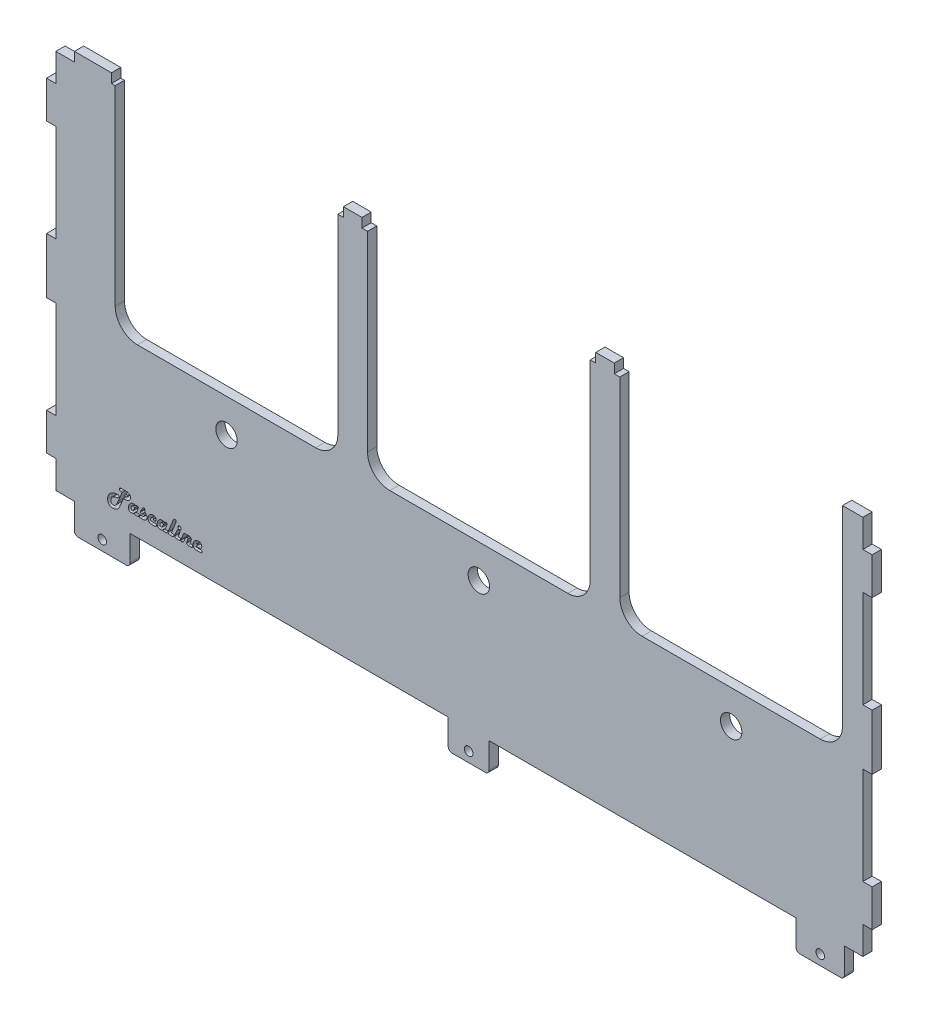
from build123d import *

# Parameters (mm, degrees)
SKETCH1_R             = 3.6703
BOSS_EXTRUDE1_DEPTH   = 3.175
FILLET1_R             = 7.62
SKETCH2_W             = 6.35
SKETCH2_H             = 3.175
SKETCH2_W_2           = 3.175
SKETCH2_H_2           = 12.7
SKETCH2_H_3           = 19.05
SKETCH2_W_3           = 19.05
SKETCH2_H_4           = 10.033
SKETCH2_W_4           = 13.97
SKETCH2_W_5           = 16.51
SKETCH2_W_6           = 12.7
BOSS_EXTRUDE2_DEPTH   = 3.175
F_4_CLEARANCE_HOLE1_D = 2.9464
FILLET2_R             = 1.27
CUT_EXTRUDE1_DEPTH    = 310.607272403


with BuildPart() as part:
    # Sketch1 → Boss-Extrude1 (new body)
    with BuildSketch(Plane.XY):
        Polygon((0, 0), (276.225, 0), (276.225, 130.175), (269.24, 130.175), (269.24, 57.15), (193.04, 57.15), (193.04, 130.175), (182.88, 130.175), (182.88, 57.15), (106.68, 57.15), (106.68, 130.175), (96.52, 130.175), (96.52, 57.15), (20.32, 57.15), (20.32, 130.175), (0, 130.175), align=None)
        with Locations((231.14, 45.72)):
            Circle(SKETCH1_R, mode=Mode.SUBTRACT)
        with Locations((58.42, 45.72)):
            Circle(SKETCH1_R, mode=Mode.SUBTRACT)
        with Locations(Location((144.78, 45.72, 0), (0, 0, 180))):
            Circle(SKETCH1_R, mode=Mode.SUBTRACT)
    extrude(amount=BOSS_EXTRUDE1_DEPTH)

    # Fillet1
    fillet1_edges = [part.edges().sort_by_distance(p)[0] for p in [
        (20.32, 57.15, 1.5875),
        (96.52, 57.15, 1.5875),
        (106.68, 57.15, 1.5875),
        (182.88, 57.15, 1.5875),
        (193.04, 57.15, 1.5875),
        (269.24, 57.15, 1.5875),
    ]]
    fillet(fillet1_edges, radius=FILLET1_R)

    # Sketch2 → Boss-Extrude2 (add)
    with BuildSketch(Plane.XY):
        with Locations((187.96, 131.7625)):
            Rectangle(SKETCH2_W, SKETCH2_H)
        with Locations((277.8125, 114.3)):
            Rectangle(SKETCH2_W_2, SKETCH2_H_2)
        with Locations((277.8125, 15.875)):
            Rectangle(SKETCH2_W_2, SKETCH2_H_2)
        with Locations((-1.5875, 65.0875)):
            Rectangle(SKETCH2_W_2, SKETCH2_H_3)
        with Locations((277.8125, 65.0875)):
            Rectangle(SKETCH2_W_2, SKETCH2_H_3)
        with Locations((-1.5875, 15.875)):
            Rectangle(SKETCH2_W_2, SKETCH2_H_2)
        with Locations((-1.5875, 114.3)):
            Rectangle(SKETCH2_W_2, SKETCH2_H_2)
        with Locations((15.875, -5.0165)):
            Rectangle(SKETCH2_W_3, SKETCH2_H_4)
        with Locations((141.2875, -5.0165)):
            Rectangle(SKETCH2_W_4, SKETCH2_H_4)
        with Locations((261.62, -5.0165)):
            Rectangle(SKETCH2_W_5, SKETCH2_H_4)
        with Locations((101.6, 131.7625)):
            Rectangle(SKETCH2_W, SKETCH2_H)
        with Locations((12.7, 131.7625)):
            Rectangle(SKETCH2_W_6, SKETCH2_H)
    extrude(amount=BOSS_EXTRUDE2_DEPTH)

    # 4 Clearance Hole1 (through all)
    with Locations(Plane.XY.offset(3.175)):
        with Locations((141.2875, -6.604), (261.62, -6.604), (15.875, -6.604)):
            Hole(F_4_CLEARANCE_HOLE1_D / 2)

    # Fillet2
    fillet2_edges = [part.edges().sort_by_distance(p)[0] for p in [
        (269.875, -10.033, 1.5875),
        (253.365, -10.033, 1.5875),
        (148.2725, -10.033, 1.5875),
        (134.3025, -10.033, 1.5875),
        (25.4, -10.033, 1.5875),
        (6.35, -10.033, 1.5875),
    ]]
    fillet(fillet2_edges, radius=FILLET2_R)

    # Sketch5 → Cut-Extrude1 (cut, through all)
    # profile 1 of 10: a face of its own
    with BuildSketch(Plane.XY.offset(3.175)):
        with BuildLine():
            Line((23.119201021, 9.164609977), (22.451206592, 7.500566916))
            add(Edge.make_bspline(
                [(22.451206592, 7.500566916), (22.411003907, 7.401430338), (22.333829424, 7.211124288), (22.219435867, 6.938643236), (22.112680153, 6.690113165), (22.012786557, 6.465475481), (21.920717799, 6.264069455), (21.833533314, 6.087517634), (21.755963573, 5.933870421), (21.661354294, 5.762755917), (21.539114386, 5.572432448), (21.375027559, 5.364837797), (21.194459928, 5.172753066), (21.060129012, 5.059889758), (20.992791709, 5.003313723)],
                knots=[0, 0, 0, 0, 1.315970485, 2.526183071, 3.635244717, 4.643279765, 5.550454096, 6.359128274, 7.065363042, 7.667512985, 8.763908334, 9.843272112, 10.918877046, 12, 12, 12, 12], degree=3))
            add(Edge.make_bspline(
                [(20.992791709, 5.003313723), (20.941866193, 4.965231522), (20.841070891, 4.889856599), (20.680401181, 4.792052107), (20.514563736, 4.708473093), (20.341573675, 4.641675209), (20.163005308, 4.589417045), (19.978244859, 4.551262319), (19.787353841, 4.528037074), (19.658056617, 4.52556047), (19.592618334, 4.524307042)],
                knots=[0, 0, 0, 0, 1.011044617, 2.001129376, 2.987597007, 3.961339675, 4.946518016, 5.943976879, 6.959431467, 8, 8, 8, 8], degree=3))
            add(Edge.make_bspline(
                [(19.592618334, 4.524307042), (19.523985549, 4.52577862), (19.389812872, 4.52865546), (19.193870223, 4.554855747), (19.007122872, 4.594062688), (18.83078106, 4.653339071), (18.663334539, 4.726507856), (18.506601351, 4.817898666), (18.35966799, 4.925082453), (18.22480845, 5.048815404), (18.102569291, 5.184697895), (17.996369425, 5.332046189), (17.904994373, 5.488467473), (17.831448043, 5.655681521), (17.774055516, 5.832504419), (17.734367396, 6.018966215), (17.708307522, 6.214954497), (17.70541107, 6.3491208), (17.70392946, 6.417750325)],
                knots=[0, 0, 0, 0, 1.095039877, 2.140732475, 3.150521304, 4.13652018, 5.104897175, 6.062745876, 7.026672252, 8.00261995, 8.979018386, 9.939223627, 10.897072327, 11.865449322, 12.849478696, 13.859267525, 14.904960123, 16, 16, 16, 16], degree=3))
            add(Edge.make_bspline(
                [(17.70392946, 6.417750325), (17.706469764, 6.510196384), (17.711485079, 6.692712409), (17.750571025, 6.961954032), (17.814671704, 7.222484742), (17.905671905, 7.473969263), (18.021297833, 7.716830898), (18.16431112, 7.949570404), (18.332042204, 8.17426002), (18.460931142, 8.313119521), (18.526442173, 8.383698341)],
                knots=[0, 0, 0, 0, 1.01377589, 2.001495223, 2.977585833, 3.952291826, 4.930103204, 5.92294397, 6.944284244, 8, 8, 8, 8], degree=3))
            add(Edge.make_bspline(
                [(18.526442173, 8.383698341), (18.564038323, 8.421013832), (18.639923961, 8.496332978), (18.762383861, 8.601213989), (18.891389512, 8.701406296), (19.026342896, 8.796968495), (19.169837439, 8.884085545), (19.318539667, 8.968473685), (19.475608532, 9.044630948), (19.690708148, 9.141268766), (19.965425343, 9.241006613), (20.2978387, 9.328678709), (20.629749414, 9.381793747), (20.850767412, 9.389158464), (20.96069945, 9.392821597)],
                knots=[0, 0, 0, 0, 0.706155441, 1.425333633, 2.148189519, 2.883981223, 3.628821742, 4.385725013, 5.163077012, 5.955384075, 7.529784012, 9.053423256, 10.534403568, 12, 12, 12, 12], degree=3))
            add(Edge.make_bspline(
                [(20.96069945, 9.392821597), (21.010777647, 9.391629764), (21.10661754, 9.389348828), (21.242284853, 9.36101028), (21.363435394, 9.317754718), (21.467338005, 9.255678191), (21.552788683, 9.180085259), (21.616087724, 9.091135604), (21.653226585, 8.989078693), (21.657440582, 8.917283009), (21.659597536, 8.880534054)],
                knots=[0, 0, 0, 0, 1.238826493, 2.370872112, 3.417595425, 4.41258701, 5.350953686, 6.225146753, 7.091533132, 8, 8, 8, 8], degree=3))
            add(Edge.make_bspline(
                [(21.659597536, 8.880534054), (21.657158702, 8.841764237), (21.65240403, 8.766179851), (21.612518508, 8.658791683), (21.545055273, 8.564566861), (21.48423124, 8.515858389), (21.452780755, 8.490672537)],
                knots=[0, 0, 0, 0, 1.010937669, 1.970891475, 2.950802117, 4, 4, 4, 4], degree=3))
            add(Edge.make_bspline(
                [(21.452780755, 8.490672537), (21.428650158, 8.476261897), (21.374303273, 8.443806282), (21.271172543, 8.413087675), (21.142728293, 8.387298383), (21.04721528, 8.377274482), (20.995168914, 8.371812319)],
                knots=[0, 0, 0, 0, 0.704559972, 1.586808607, 2.68501851, 4, 4, 4, 4], degree=3))
            add(Edge.make_bspline(
                [(20.995168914, 8.371812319), (20.930899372, 8.36533971), (20.80556437, 8.352717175), (20.622961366, 8.323144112), (20.44919412, 8.289935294), (20.285218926, 8.246571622), (20.130183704, 8.19766871), (19.983692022, 8.144126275), (19.847574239, 8.080489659), (19.761927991, 8.032764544), (19.719798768, 8.009288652)],
                knots=[0, 0, 0, 0, 1.159710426, 2.261604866, 3.320677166, 4.335395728, 5.305245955, 6.239579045, 7.134052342, 8, 8, 8, 8], degree=3))
            add(Edge.make_bspline(
                [(19.719798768, 8.009288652), (19.654419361, 7.967339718), (19.52562533, 7.884702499), (19.354426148, 7.733222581), (19.203332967, 7.564964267), (19.075629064, 7.379109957), (18.973627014, 7.181271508), (18.89879096, 6.976254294), (18.852926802, 6.765270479), (18.847636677, 6.622412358), (18.844987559, 6.550873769)],
                knots=[0, 0, 0, 0, 1.047576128, 2.063670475, 3.075290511, 4.094745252, 5.099666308, 6.072755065, 7.034899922, 8, 8, 8, 8], degree=3))
            add(Edge.make_bspline(
                [(18.844987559, 6.550873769), (18.845636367, 6.515185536), (18.846908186, 6.445228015), (18.857899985, 6.343133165), (18.875018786, 6.246246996), (18.901788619, 6.15588907), (18.933862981, 6.070634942), (18.972695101, 5.990387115), (19.020918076, 5.917086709), (19.073977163, 5.848438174), (19.13513267, 5.788442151), (19.199905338, 5.73415304), (19.271326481, 5.690354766), (19.346543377, 5.652700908), (19.427352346, 5.624580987), (19.513023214, 5.604540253), (19.603256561, 5.590584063), (19.665464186, 5.589730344), (19.697215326, 5.589294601)],
                knots=[0, 0, 0, 0, 1.180906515, 2.314860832, 3.395146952, 4.432720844, 5.428859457, 6.408284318, 7.375873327, 8.328235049, 9.274073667, 10.205991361, 11.119268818, 12.040047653, 12.985704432, 13.943108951, 14.9501506, 16, 16, 16, 16], degree=3))
            add(Edge.make_bspline(
                [(19.697215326, 5.589294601), (19.73772721, 5.590178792), (19.817696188, 5.591924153), (19.934736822, 5.613557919), (20.047745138, 5.64535598), (20.156538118, 5.691126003), (20.261491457, 5.749525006), (20.361851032, 5.821430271), (20.457232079, 5.906838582), (20.550130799, 6.005691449), (20.640514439, 6.122252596), (20.735291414, 6.255321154), (20.829339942, 6.410668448), (20.926497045, 6.585296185), (21.026287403, 6.779583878), (21.128874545, 6.99369617), (21.231187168, 7.22917089), (21.299659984, 7.393110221), (21.335109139, 7.477983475)],
                knots=[0, 0, 0, 0, 0.731682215, 1.444313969, 2.14503258, 2.851587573, 3.573238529, 4.31284086, 5.079201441, 5.885132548, 6.76239785, 7.744387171, 8.838039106, 10.04403949, 11.357848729, 12.787140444, 14.336666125, 16, 16, 16, 16], degree=3))
            Line((21.335109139, 7.477983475), (22.730528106, 10.914232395))
            Line((22.730528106, 10.914232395), (22.293122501, 10.914232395))
            add(Edge.make_bspline(
                [(22.293122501, 10.914232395), (22.249482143, 10.915318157), (22.167784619, 10.917350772), (22.053469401, 10.933486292), (21.955911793, 10.96103767), (21.875553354, 11.001448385), (21.812083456, 11.0538411), (21.766552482, 11.118910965), (21.739607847, 11.196317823), (21.737016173, 11.251577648), (21.735668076, 11.280321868)],
                knots=[0, 0, 0, 0, 1.386647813, 2.595892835, 3.659749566, 4.594681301, 5.434731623, 6.248703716, 7.089037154, 8, 8, 8, 8], degree=3))
            add(Edge.make_bspline(
                [(21.735668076, 11.280321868), (21.737604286, 11.321461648), (21.741339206, 11.400819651), (21.780099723, 11.512122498), (21.841922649, 11.609323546), (21.930694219, 11.688476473), (22.040352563, 11.751577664), (22.17060237, 11.796320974), (22.320267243, 11.821779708), (22.426142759, 11.825246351), (22.482110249, 11.827078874)],
                knots=[0, 0, 0, 0, 0.942601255, 1.818263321, 2.674766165, 3.564433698, 4.523656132, 5.566505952, 6.713616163, 8, 8, 8, 8], degree=3))
            Line((22.482110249, 11.827078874), (24.009464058, 11.827078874))
            add(Edge.make_bspline(
                [(24.009464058, 11.827078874), (24.07248493, 11.826141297), (24.194705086, 11.824322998), (24.371659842, 11.811086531), (24.536158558, 11.790426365), (24.687661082, 11.7598162), (24.826003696, 11.719494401), (24.951704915, 11.670604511), (25.065549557, 11.614116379), (25.166457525, 11.546868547), (25.254881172, 11.47075861), (25.331318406, 11.384834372), (25.394973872, 11.289168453), (25.449869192, 11.185035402), (25.489653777, 11.069843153), (25.51766631, 10.945418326), (25.536143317, 10.81176616), (25.53815736, 10.719365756), (25.539195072, 10.671757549)],
                knots=[0, 0, 0, 0, 1.377685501, 2.671828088, 3.877302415, 5.000186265, 6.047243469, 7.023626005, 7.94558449, 8.820055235, 9.667510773, 10.489711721, 11.325757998, 12.174186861, 13.056345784, 13.980864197, 14.959664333, 16, 16, 16, 16], degree=3))
            add(Edge.make_bspline(
                [(25.539195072, 10.671757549), (25.537217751, 10.613032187), (25.533336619, 10.497764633), (25.507219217, 10.328808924), (25.461558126, 10.168586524), (25.398541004, 10.016101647), (25.315426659, 9.873155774), (25.215734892, 9.73744145), (25.098243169, 9.609536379), (25.007634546, 9.534438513), (24.961534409, 9.496229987)],
                knots=[0, 0, 0, 0, 1.037190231, 2.03582197, 3.010506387, 3.973515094, 4.942177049, 5.923321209, 6.943420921, 8, 8, 8, 8], degree=3))
            add(Edge.make_bspline(
                [(24.961534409, 9.496229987), (24.924861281, 9.469591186), (24.849567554, 9.414898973), (24.722279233, 9.347795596), (24.581294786, 9.290628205), (24.42582274, 9.24494617), (24.257052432, 9.208122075), (24.073914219, 9.182358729), (23.876613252, 9.166850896), (23.740077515, 9.16537344), (23.669523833, 9.164609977)],
                knots=[0, 0, 0, 0, 0.800437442, 1.643380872, 2.535600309, 3.486195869, 4.50417187, 5.586788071, 6.752993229, 8, 8, 8, 8], degree=3))
            Line((23.669523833, 9.164609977), (23.119201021, 9.164609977))
        make_face()
        with BuildLine():
            Line((23.509062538, 10.077456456), (23.833550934, 10.077456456))
            add(Edge.make_bspline(
                [(23.833550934, 10.077456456), (23.883581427, 10.078871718), (23.978009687, 10.081542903), (24.109812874, 10.105830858), (24.222265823, 10.147368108), (24.315221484, 10.206091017), (24.38842248, 10.283422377), (24.437974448, 10.379084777), (24.470358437, 10.489814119), (24.47287967, 10.569284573), (24.474207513, 10.611138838)],
                knots=[0, 0, 0, 0, 1.258971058, 2.376199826, 3.358208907, 4.260347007, 5.121448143, 6.005251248, 6.949436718, 8, 8, 8, 8], degree=3))
            add(Edge.make_bspline(
                [(24.474207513, 10.611138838), (24.473067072, 10.634992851), (24.470906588, 10.680182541), (24.45485612, 10.743618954), (24.424912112, 10.796445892), (24.384765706, 10.841296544), (24.331090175, 10.873849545), (24.267531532, 10.898068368), (24.192697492, 10.911946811), (24.139079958, 10.913437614), (24.110495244, 10.914232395)],
                knots=[0, 0, 0, 0, 1.057975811, 2.004258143, 2.869579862, 3.727735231, 4.644179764, 5.623179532, 6.73286349, 8, 8, 8, 8], degree=3))
            Line((24.110495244, 10.914232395), (23.84187115, 10.914232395))
            Line((23.84187115, 10.914232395), (23.509062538, 10.077456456))
        make_face(mode=Mode.SUBTRACT)
    # profile 2 of 10: a face of its own
    with BuildSketch(Plane.XY.offset(3.175)):
        with BuildLine():
            Line((27.590722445, 7.262846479), (28.032882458, 7.262846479))
            add(Edge.make_bspline(
                [(28.032882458, 7.262846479), (28.069771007, 7.26168404), (28.139217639, 7.259495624), (28.237100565, 7.244044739), (28.319497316, 7.213913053), (28.389453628, 7.175207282), (28.441730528, 7.120759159), (28.479643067, 7.055670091), (28.502815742, 6.978700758), (28.504866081, 6.923472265), (28.505946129, 6.894379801)],
                knots=[0, 0, 0, 0, 1.294214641, 2.436497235, 3.45633191, 4.35958604, 5.214514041, 6.067746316, 6.982155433, 8, 8, 8, 8], degree=3))
            add(Edge.make_bspline(
                [(28.505946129, 6.894379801), (28.504075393, 6.853751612), (28.500488, 6.775841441), (28.467922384, 6.66547908), (28.411237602, 6.570686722), (28.335484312, 6.489620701), (28.239850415, 6.426705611), (28.127852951, 6.380604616), (27.999107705, 6.355527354), (27.90818237, 6.351900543), (27.860535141, 6.35)],
                knots=[0, 0, 0, 0, 1.02006706, 1.956119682, 2.85821293, 3.77438774, 4.72208319, 5.713685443, 6.801912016, 8, 8, 8, 8], degree=3))
            Line((27.860535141, 6.35), (27.347058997, 6.35))
            add(Edge.make_bspline(
                [(27.347058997, 6.35), (27.319272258, 6.350924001), (27.266140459, 6.35269081), (27.189661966, 6.365809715), (27.119931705, 6.388489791), (27.056725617, 6.420297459), (27.001086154, 6.461923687), (26.951568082, 6.511009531), (26.909321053, 6.570088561), (26.888358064, 6.614676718), (26.877561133, 6.637641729)],
                knots=[0, 0, 0, 0, 1.135602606, 2.17141737, 3.159933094, 4.123316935, 5.049777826, 5.988893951, 6.964185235, 8, 8, 8, 8], degree=3))
            add(Edge.make_bspline(
                [(26.877561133, 6.637641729), (26.829418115, 6.593791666), (26.738706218, 6.511168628), (26.589078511, 6.421916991), (26.442765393, 6.360717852), (26.343224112, 6.353490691), (26.295146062, 6.35)],
                knots=[0, 0, 0, 0, 1.172355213, 2.208971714, 3.134940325, 4, 4, 4, 4], degree=3))
            Line((26.295146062, 6.35), (25.838722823, 6.35))
            add(Edge.make_bspline(
                [(25.838722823, 6.35), (25.802613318, 6.350846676), (25.732080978, 6.352500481), (25.629021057, 6.36739538), (25.530996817, 6.390336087), (25.439134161, 6.425910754), (25.351766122, 6.468220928), (25.269891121, 6.521254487), (25.194345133, 6.584489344), (25.123714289, 6.655720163), (25.061392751, 6.735720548), (25.004824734, 6.82093039), (24.958631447, 6.913392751), (24.9203783, 7.011259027), (24.891018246, 7.114802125), (24.869013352, 7.224008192), (24.857836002, 7.339477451), (24.855668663, 7.418533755), (24.854560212, 7.45896584)],
                knots=[0, 0, 0, 0, 1.038881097, 2.029236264, 2.991883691, 3.930308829, 4.858629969, 5.782385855, 6.730121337, 7.689859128, 8.664191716, 9.644845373, 10.629272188, 11.633194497, 12.665607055, 13.723595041, 14.835769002, 16, 16, 16, 16], degree=3))
            add(Edge.make_bspline(
                [(24.854560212, 7.45896584), (24.85610135, 7.520862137), (24.859147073, 7.643186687), (24.885247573, 7.824235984), (24.926425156, 8.000246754), (24.985151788, 8.171403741), (25.060821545, 8.33685869), (25.150817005, 8.498507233), (25.260719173, 8.653277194), (25.383466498, 8.802278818), (25.517065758, 8.939411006), (25.65634466, 9.060947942), (25.801550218, 9.162226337), (25.949498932, 9.247803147), (26.103529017, 9.312208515), (26.26118757, 9.359174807), (26.423717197, 9.387067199), (26.533554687, 9.390897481), (26.588730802, 9.392821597)],
                knots=[0, 0, 0, 0, 1.038393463, 2.052158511, 3.063456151, 4.068635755, 5.08344709, 6.113632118, 7.168837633, 8.264602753, 9.350863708, 10.378663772, 11.361961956, 12.31789787, 13.241700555, 14.156967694, 15.07416527, 16, 16, 16, 16], degree=3))
            add(Edge.make_bspline(
                [(26.588730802, 9.392821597), (26.629955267, 9.391802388), (26.709847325, 9.389827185), (26.825936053, 9.377663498), (26.93284671, 9.352720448), (27.032648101, 9.323430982), (27.12225627, 9.280706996), (27.204008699, 9.230733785), (27.277694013, 9.171469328), (27.318416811, 9.124076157), (27.338738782, 9.100425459)],
                knots=[0, 0, 0, 0, 1.187749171, 2.30183041, 3.353985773, 4.346587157, 5.291117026, 6.203238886, 7.103359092, 8, 8, 8, 8], degree=3))
            add(Edge.make_bspline(
                [(27.338738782, 9.100425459), (27.355674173, 9.123800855), (27.388572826, 9.169209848), (27.444893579, 9.229036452), (27.505129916, 9.279630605), (27.568893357, 9.321936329), (27.638154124, 9.352158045), (27.709275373, 9.377183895), (27.78560771, 9.389834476), (27.837518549, 9.391809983), (27.864100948, 9.392821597)],
                knots=[0, 0, 0, 0, 1.102961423, 2.142610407, 3.131917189, 4.106850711, 5.056016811, 6.014208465, 6.983119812, 8, 8, 8, 8], degree=3))
            add(Edge.make_bspline(
                [(27.864100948, 9.392821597), (27.892332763, 9.391374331), (27.947568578, 9.388542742), (28.026788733, 9.368747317), (28.097661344, 9.332619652), (28.159912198, 9.285477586), (28.212990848, 9.22913499), (28.25007614, 9.163329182), (28.274365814, 9.091402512), (28.276592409, 9.040801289), (28.277734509, 9.014846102)],
                knots=[0, 0, 0, 0, 1.085152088, 2.123110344, 3.11068521, 4.121931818, 5.11360817, 6.061884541, 7.005870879, 8, 8, 8, 8], degree=3))
            add(Edge.make_bspline(
                [(28.277734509, 9.014846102), (28.277038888, 8.995776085), (28.275563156, 8.955319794), (28.262690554, 8.892397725), (28.242496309, 8.824341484), (28.223506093, 8.778549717), (28.213549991, 8.754542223)],
                knots=[0, 0, 0, 0, 0.847236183, 1.797378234, 2.845219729, 4, 4, 4, 4], degree=3))
            Line((28.213549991, 8.754542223), (28.16957171, 8.648756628))
            Line((28.16957171, 8.648756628), (27.590722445, 7.262846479))
        make_face()
        with BuildLine():
            Line((26.134684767, 7.262846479), (26.235715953, 7.262846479))
            add(Edge.make_bspline(
                [(26.235715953, 7.262846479), (26.261118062, 7.263403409), (26.310245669, 7.264480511), (26.380704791, 7.276313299), (26.444219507, 7.296625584), (26.501442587, 7.324150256), (26.551533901, 7.360081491), (26.595304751, 7.403527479), (26.631459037, 7.455722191), (26.649532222, 7.494711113), (26.658858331, 7.514830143)],
                knots=[0, 0, 0, 0, 1.157664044, 2.238919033, 3.244614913, 4.190073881, 5.122668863, 6.042574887, 6.989931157, 8, 8, 8, 8], degree=3))
            Line((26.658858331, 7.514830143), (26.92985963, 8.166184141))
            add(Edge.make_bspline(
                [(26.92985963, 8.166184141), (26.946051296, 8.204845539), (26.974847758, 8.27360384), (26.981585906, 8.347699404), (26.98453533, 8.380132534)],
                knots=[0, 0, 0, 0, 1.124559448, 2, 2, 2, 2], degree=3))
            add(Edge.make_bspline(
                [(26.98453533, 8.380132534), (26.982919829, 8.396510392), (26.979660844, 8.429549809), (26.960273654, 8.478036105), (26.923140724, 8.519372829), (26.877468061, 8.558290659), (26.822149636, 8.591249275), (26.759781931, 8.614843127), (26.692035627, 8.629673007), (26.645070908, 8.631284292), (26.620823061, 8.632116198)],
                knots=[0, 0, 0, 0, 0.81058345, 1.635208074, 2.524363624, 3.523748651, 4.593951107, 5.683817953, 6.804157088, 8, 8, 8, 8], degree=3))
            add(Edge.make_bspline(
                [(26.620823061, 8.632116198), (26.596174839, 8.63128371), (26.546394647, 8.629602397), (26.472572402, 8.613117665), (26.399545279, 8.588130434), (26.327079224, 8.552743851), (26.255132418, 8.507577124), (26.183183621, 8.452598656), (26.113420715, 8.386315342), (26.021876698, 8.289084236), (25.923002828, 8.158030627), (25.834330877, 7.992365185), (25.778103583, 7.822683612), (25.770947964, 7.707389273), (25.767406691, 7.650330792)],
                knots=[0, 0, 0, 0, 0.627706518, 1.267732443, 1.919531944, 2.592823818, 3.31892668, 4.082778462, 4.897707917, 5.769757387, 7.487317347, 9.064628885, 10.547302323, 12, 12, 12, 12], degree=3))
            add(Edge.make_bspline(
                [(25.767406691, 7.650330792), (25.768547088, 7.620143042), (25.770712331, 7.562826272), (25.786711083, 7.482537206), (25.814989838, 7.413874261), (25.857126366, 7.358291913), (25.910530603, 7.314821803), (25.97542406, 7.283164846), (26.051786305, 7.265877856), (26.106072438, 7.263892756), (26.134684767, 7.262846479)],
                knots=[0, 0, 0, 0, 1.183693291, 2.247450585, 3.194323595, 4.070859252, 4.954393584, 5.871857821, 6.878330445, 8, 8, 8, 8], degree=3))
        make_face(mode=Mode.SUBTRACT)
    # profile 3 of 10: a face of its own
    with BuildSketch(Plane.XY.offset(3.175)):
        with BuildLine():
            Line((29.990510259, 8.330211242), (29.912062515, 8.16024113))
            add(Edge.make_bspline(
                [(29.912062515, 8.16024113), (29.896884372, 8.131312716), (29.86769618, 8.07568219), (29.814544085, 8.00141012), (29.757815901, 7.937540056), (29.695046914, 7.885850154), (29.628129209, 7.844607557), (29.555769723, 7.815808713), (29.478606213, 7.79887687), (29.425612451, 7.796534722), (29.39858637, 7.795340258)],
                knots=[0, 0, 0, 0, 1.174117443, 2.257875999, 3.277186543, 4.239058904, 5.172954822, 6.09414408, 7.028039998, 8, 8, 8, 8], degree=3))
            add(Edge.make_bspline(
                [(29.39858637, 7.795340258), (29.371134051, 7.796795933), (29.316667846, 7.799684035), (29.237096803, 7.82031378), (29.16263589, 7.855638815), (29.09462143, 7.902428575), (29.037107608, 7.958103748), (28.993789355, 8.019877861), (28.967174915, 8.086882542), (28.963967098, 8.133470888), (28.962369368, 8.156675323)],
                knots=[0, 0, 0, 0, 1.057292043, 2.097698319, 3.142574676, 4.21811325, 5.26521749, 6.20945791, 7.108177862, 8, 8, 8, 8], degree=3))
            add(Edge.make_bspline(
                [(28.962369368, 8.156675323), (28.963902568, 8.18098518), (28.967274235, 8.234445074), (28.992789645, 8.318434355), (29.027799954, 8.414397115), (29.061029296, 8.47951667), (29.078852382, 8.514444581)],
                knots=[0, 0, 0, 0, 0.768398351, 1.68978755, 2.760880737, 4, 4, 4, 4], degree=3))
            Line((29.078852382, 8.514444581), (29.612534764, 9.55209429))
            add(Edge.make_bspline(
                [(29.612534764, 9.55209429), (29.628998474, 9.581760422), (29.660355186, 9.638262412), (29.714608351, 9.714353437), (29.771846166, 9.778597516), (29.830813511, 9.833390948), (29.894697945, 9.874194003), (29.961322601, 9.90314064), (30.030689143, 9.921974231), (30.078349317, 9.92419981), (30.102238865, 9.925315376)],
                knots=[0, 0, 0, 0, 1.254889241, 2.390056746, 3.44940031, 4.435704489, 5.358962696, 6.23882182, 7.117213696, 8, 8, 8, 8], degree=3))
            add(Edge.make_bspline(
                [(30.102238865, 9.925315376), (30.127723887, 9.924333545), (30.177477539, 9.922416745), (30.249027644, 9.902648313), (30.314253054, 9.870016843), (30.371649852, 9.82561983), (30.422350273, 9.775108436), (30.456581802, 9.715249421), (30.480139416, 9.651678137), (30.482550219, 9.606987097), (30.483780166, 9.584186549)],
                knots=[0, 0, 0, 0, 1.076175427, 2.100985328, 3.113101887, 4.142426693, 5.162150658, 6.116677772, 7.039163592, 8, 8, 8, 8], degree=3))
            add(Edge.make_bspline(
                [(30.483780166, 9.584186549), (30.483189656, 9.576625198), (30.481707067, 9.55764097), (30.472108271, 9.524410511), (30.457923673, 9.48041725), (30.445526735, 9.447837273), (30.438613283, 9.429668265)],
                knots=[0, 0, 0, 0, 0.562304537, 1.411773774, 2.556613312, 4, 4, 4, 4], degree=3))
            add(Edge.make_bspline(
                [(30.438613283, 9.429668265), (30.429934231, 9.4021552), (30.4139082, 9.351351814), (30.409658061, 9.29828798), (30.407709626, 9.273961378)],
                knots=[0, 0, 0, 0, 1.083119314, 2, 2, 2, 2], degree=3))
            add(Edge.make_bspline(
                [(30.407709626, 9.273961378), (30.410360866, 9.231672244), (30.41576673, 9.145444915), (30.457407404, 9.016624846), (30.521341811, 8.886134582), (30.581783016, 8.805145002), (30.613337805, 8.762862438)],
                knots=[0, 0, 0, 0, 0.903479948, 1.84219102, 2.873463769, 4, 4, 4, 4], degree=3))
            Line((30.613337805, 8.762862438), (30.862944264, 8.449071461))
            add(Edge.make_bspline(
                [(30.862944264, 8.449071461), (30.89315876, 8.40941273), (30.95181765, 8.332418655), (31.029517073, 8.213642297), (31.096639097, 8.096689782), (31.150204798, 7.979553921), (31.192582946, 7.863611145), (31.222000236, 7.748525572), (31.241056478, 7.634323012), (31.243346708, 7.558484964), (31.244485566, 7.520773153)],
                knots=[0, 0, 0, 0, 1.169686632, 2.270847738, 3.328397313, 4.331060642, 5.289870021, 6.221237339, 7.115478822, 8, 8, 8, 8], degree=3))
            add(Edge.make_bspline(
                [(31.244485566, 7.520773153), (31.243374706, 7.479898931), (31.241185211, 7.399336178), (31.222953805, 7.281348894), (31.193158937, 7.168541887), (31.151222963, 7.060930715), (31.097710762, 6.958280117), (31.031457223, 6.861340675), (30.953690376, 6.769443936), (30.865170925, 6.683679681), (30.768195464, 6.604874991), (30.663003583, 6.537900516), (30.55370701, 6.478341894), (30.437152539, 6.432662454), (30.315721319, 6.395108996), (30.188203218, 6.369932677), (30.055210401, 6.351843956), (29.964426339, 6.35062387), (29.918005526, 6.35)],
                knots=[0, 0, 0, 0, 0.993241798, 1.957671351, 2.894532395, 3.824635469, 4.759513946, 5.702543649, 6.673110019, 7.681185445, 8.695042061, 9.70491044, 10.708882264, 11.715852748, 12.742665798, 13.794825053, 14.872423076, 16, 16, 16, 16], degree=3))
            Line((29.918005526, 6.35), (29.080040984, 6.35))
            add(Edge.make_bspline(
                [(29.080040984, 6.35), (29.041166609, 6.351148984), (28.968164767, 6.353306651), (28.865667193, 6.368799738), (28.778850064, 6.39860707), (28.70672086, 6.439016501), (28.649687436, 6.491477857), (28.609138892, 6.556610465), (28.58673032, 6.634252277), (28.583643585, 6.689400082), (28.582016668, 6.718466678)],
                knots=[0, 0, 0, 0, 1.323532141, 2.485449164, 3.513452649, 4.431917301, 5.281225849, 6.123328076, 7.010867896, 8, 8, 8, 8], degree=3))
            add(Edge.make_bspline(
                [(28.582016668, 6.718466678), (28.583766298, 6.759131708), (28.587126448, 6.837228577), (28.621444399, 6.947402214), (28.678777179, 7.042559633), (28.758030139, 7.122462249), (28.857096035, 7.185049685), (28.972704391, 7.232327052), (29.105937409, 7.257322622), (29.199599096, 7.26094353), (29.248822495, 7.262846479)],
                knots=[0, 0, 0, 0, 1.001377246, 1.923137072, 2.813709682, 3.719614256, 4.674449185, 5.687788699, 6.784829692, 8, 8, 8, 8], degree=3))
            Line((29.248822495, 7.262846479), (29.71356595, 7.262846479))
            add(Edge.make_bspline(
                [(29.71356595, 7.262846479), (29.761976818, 7.263714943), (29.852890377, 7.265345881), (29.979460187, 7.28416678), (30.087169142, 7.314282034), (30.176102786, 7.356875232), (30.246912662, 7.412505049), (30.297305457, 7.482368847), (30.326991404, 7.565690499), (30.330040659, 7.625120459), (30.331639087, 7.656273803)],
                knots=[0, 0, 0, 0, 1.402558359, 2.633945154, 3.698995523, 4.63394819, 5.475307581, 6.281836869, 7.099334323, 8, 8, 8, 8], degree=3))
            add(Edge.make_bspline(
                [(30.331639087, 7.656273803), (30.329759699, 7.681390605), (30.325750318, 7.734973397), (30.29981842, 7.817251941), (30.260510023, 7.906123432), (30.223911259, 7.964172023), (30.204458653, 7.995025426)],
                knots=[0, 0, 0, 0, 0.822745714, 1.755200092, 2.806866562, 4, 4, 4, 4], degree=3))
            Line((30.204458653, 7.995025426), (29.990510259, 8.330211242))
        make_face()
    # profile 4 of 10: a face of its own
    with BuildSketch(Plane.XY.offset(3.175)):
        with BuildLine():
            Line((33.843958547, 6.35), (32.680317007, 6.35))
            add(Edge.make_bspline(
                [(32.680317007, 6.35), (32.639473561, 6.351331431), (32.559475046, 6.353939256), (32.442122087, 6.368805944), (32.331089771, 6.397249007), (32.224677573, 6.432858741), (32.125228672, 6.482977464), (32.031435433, 6.542005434), (31.943344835, 6.612135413), (31.862148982, 6.692296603), (31.788904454, 6.781373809), (31.723642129, 6.876673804), (31.67087138, 6.979950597), (31.624984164, 7.087986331), (31.590247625, 7.203147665), (31.567630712, 7.324780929), (31.550914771, 7.452170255), (31.549492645, 7.539336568), (31.548767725, 7.583769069)],
                knots=[0, 0, 0, 0, 1.04308008, 2.043041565, 3.012085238, 3.965374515, 4.901770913, 5.84746328, 6.790555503, 7.770466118, 8.754752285, 9.731054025, 10.712842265, 11.710345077, 12.724731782, 13.776116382, 14.86638876, 16, 16, 16, 16], degree=3))
            add(Edge.make_bspline(
                [(31.548767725, 7.583769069), (31.550434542, 7.643669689), (31.553726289, 7.761965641), (31.577855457, 7.936444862), (31.618616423, 8.105181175), (31.675046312, 8.268099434), (31.750410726, 8.42377383), (31.839361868, 8.574392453), (31.946140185, 8.718148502), (32.065971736, 8.855189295), (32.19833574, 8.979735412), (32.336825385, 9.090917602), (32.481896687, 9.184309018), (32.632077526, 9.261377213), (32.789231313, 9.319248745), (32.951349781, 9.362816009), (33.119703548, 9.388030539), (33.233728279, 9.391214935), (33.29125853, 9.392821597)],
                knots=[0, 0, 0, 0, 1.033018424, 2.040077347, 3.031267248, 4.023304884, 5.007568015, 6.009629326, 7.036117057, 8.091719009, 9.145549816, 10.16692925, 11.15074152, 12.116516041, 13.072326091, 14.033738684, 15.007938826, 16, 16, 16, 16], degree=3))
            add(Edge.make_bspline(
                [(33.29125853, 9.392821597), (33.330123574, 9.39229061), (33.406065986, 9.391253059), (33.516835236, 9.378681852), (33.62234278, 9.360223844), (33.721984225, 9.332564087), (33.816684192, 9.298575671), (33.904919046, 9.254933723), (33.988753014, 9.205465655), (34.065535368, 9.147041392), (34.135215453, 9.083436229), (34.197063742, 9.015218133), (34.248354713, 8.941154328), (34.289538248, 8.862143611), (34.324343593, 8.779529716), (34.345526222, 8.691155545), (34.361010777, 8.598583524), (34.362575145, 8.535117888), (34.363377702, 8.502558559)],
                knots=[0, 0, 0, 0, 1.192851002, 2.330834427, 3.419016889, 4.478598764, 5.502444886, 6.503631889, 7.49680333, 8.487139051, 9.460210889, 10.390750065, 11.308717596, 12.217610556, 13.123567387, 14.053072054, 15.001181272, 16, 16, 16, 16], degree=3))
            add(Edge.make_bspline(
                [(34.363377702, 8.502558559), (34.361783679, 8.458384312), (34.358716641, 8.37338923), (34.328641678, 8.252278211), (34.283123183, 8.141976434), (34.216010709, 8.047284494), (34.135293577, 7.969033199), (34.041830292, 7.91161127), (33.936681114, 7.87676091), (33.862847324, 7.873225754), (33.824940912, 7.871410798)],
                knots=[0, 0, 0, 0, 1.140049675, 2.193554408, 3.207776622, 4.208142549, 5.171800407, 6.095933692, 7.022448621, 8, 8, 8, 8], degree=3))
            add(Edge.make_bspline(
                [(33.824940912, 7.871410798), (33.795542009, 7.87215502), (33.740311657, 7.873553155), (33.663568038, 7.888085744), (33.597715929, 7.909794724), (33.543778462, 7.942790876), (33.500419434, 7.984790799), (33.471820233, 8.038507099), (33.453420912, 8.100004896), (33.451523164, 8.144247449), (33.450531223, 8.167372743)],
                knots=[0, 0, 0, 0, 1.293872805, 2.430738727, 3.43019671, 4.33150824, 5.195698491, 6.055468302, 6.983605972, 8, 8, 8, 8], degree=3))
            add(Edge.make_bspline(
                [(33.450531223, 8.167372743), (33.450531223, 8.181239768), (33.450531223, 8.206596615), (33.450531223, 8.231953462), (33.450531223, 8.243443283)],
                knots=[0, 0, 0, 0, 1.09375, 2, 2, 2, 2], degree=3))
            add(Edge.make_bspline(
                [(33.450531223, 8.243443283), (33.450531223, 8.255725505), (33.450531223, 8.279497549), (33.450531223, 8.303269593), (33.450531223, 8.314759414)],
                knots=[0, 0, 0, 0, 1.033333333, 2, 2, 2, 2], degree=3))
            add(Edge.make_bspline(
                [(33.450531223, 8.314759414), (33.44967953, 8.333876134), (33.448077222, 8.369840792), (33.434613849, 8.419916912), (33.413511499, 8.463087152), (33.380914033, 8.497551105), (33.339478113, 8.523737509), (33.289753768, 8.542520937), (33.231618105, 8.554749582), (33.189901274, 8.555594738), (33.167643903, 8.556045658)],
                knots=[0, 0, 0, 0, 1.076936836, 2.026062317, 2.906040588, 3.760364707, 4.665822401, 5.649858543, 6.746118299, 8, 8, 8, 8], degree=3))
            add(Edge.make_bspline(
                [(33.167643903, 8.556045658), (33.123621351, 8.553163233), (33.034942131, 8.547356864), (32.906677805, 8.495910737), (32.786484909, 8.413771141), (32.676556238, 8.304885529), (32.583034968, 8.177699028), (32.511892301, 8.039385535), (32.470278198, 7.891609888), (32.464516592, 7.790439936), (32.461614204, 7.739475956)],
                knots=[0, 0, 0, 0, 0.889989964, 1.79279967, 2.759962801, 3.828151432, 4.914528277, 5.949409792, 6.967022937, 8, 8, 8, 8], degree=3))
            add(Edge.make_bspline(
                [(32.461614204, 7.739475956), (32.463855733, 7.699247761), (32.468094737, 7.623171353), (32.500732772, 7.517048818), (32.560782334, 7.431656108), (32.643809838, 7.363978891), (32.755272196, 7.317078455), (32.894754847, 7.2858988), (33.064490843, 7.266324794), (33.187790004, 7.264066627), (33.254411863, 7.262846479)],
                knots=[0, 0, 0, 0, 0.913027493, 1.726645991, 2.482782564, 3.249916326, 4.127695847, 5.201188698, 6.487726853, 8, 8, 8, 8], degree=3))
            Line((33.254411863, 7.262846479), (34.012740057, 7.262846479))
            add(Edge.make_bspline(
                [(34.012740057, 7.262846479), (34.052054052, 7.261906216), (34.125991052, 7.260137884), (34.229054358, 7.242045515), (34.317391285, 7.214818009), (34.390470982, 7.173472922), (34.447565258, 7.119330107), (34.488145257, 7.052929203), (34.510965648, 6.974664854), (34.513940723, 6.919099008), (34.515518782, 6.889625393)],
                knots=[0, 0, 0, 0, 1.322009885, 2.486276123, 3.511116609, 4.419281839, 5.287086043, 6.131096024, 7.008683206, 8, 8, 8, 8], degree=3))
            add(Edge.make_bspline(
                [(34.515518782, 6.889625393), (34.513867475, 6.849711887), (34.510676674, 6.772587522), (34.474586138, 6.664416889), (34.416987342, 6.569236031), (34.336227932, 6.489587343), (34.236195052, 6.426608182), (34.119790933, 6.380845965), (33.986884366, 6.355420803), (33.893195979, 6.351867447), (33.843958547, 6.35)],
                knots=[0, 0, 0, 0, 0.982987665, 1.899414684, 2.782606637, 3.710260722, 4.674394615, 5.685217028, 6.783478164, 8, 8, 8, 8], degree=3))
        make_face()
    # profile 5 of 10: a face of its own
    with BuildSketch(Plane.XY.offset(3.175)):
        with BuildLine():
            Line((37.403822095, 7.262846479), (37.845982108, 7.262846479))
            add(Edge.make_bspline(
                [(37.845982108, 7.262846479), (37.882870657, 7.26168404), (37.952317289, 7.259495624), (38.050200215, 7.244044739), (38.132596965, 7.213913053), (38.202553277, 7.175207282), (38.254830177, 7.120759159), (38.292742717, 7.055670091), (38.315915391, 6.978700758), (38.31796573, 6.923472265), (38.319045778, 6.894379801)],
                knots=[0, 0, 0, 0, 1.294214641, 2.436497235, 3.45633191, 4.35958604, 5.214514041, 6.067746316, 6.982155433, 8, 8, 8, 8], degree=3))
            add(Edge.make_bspline(
                [(38.319045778, 6.894379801), (38.317175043, 6.853751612), (38.313587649, 6.775841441), (38.281022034, 6.66547908), (38.224337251, 6.570686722), (38.148583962, 6.489620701), (38.052950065, 6.426705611), (37.9409526, 6.380604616), (37.812207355, 6.355527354), (37.721282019, 6.351900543), (37.673634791, 6.35)],
                knots=[0, 0, 0, 0, 1.02006706, 1.956119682, 2.85821293, 3.77438774, 4.72208319, 5.713685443, 6.801912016, 8, 8, 8, 8], degree=3))
            Line((37.673634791, 6.35), (37.160158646, 6.35))
            add(Edge.make_bspline(
                [(37.160158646, 6.35), (37.132371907, 6.350924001), (37.079240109, 6.35269081), (37.002761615, 6.365809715), (36.933031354, 6.388489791), (36.869825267, 6.420297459), (36.814185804, 6.461923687), (36.764667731, 6.511009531), (36.722420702, 6.570088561), (36.701457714, 6.614676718), (36.690660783, 6.637641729)],
                knots=[0, 0, 0, 0, 1.135602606, 2.17141737, 3.159933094, 4.123316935, 5.049777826, 5.988893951, 6.964185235, 8, 8, 8, 8], degree=3))
            add(Edge.make_bspline(
                [(36.690660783, 6.637641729), (36.642517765, 6.593791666), (36.551805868, 6.511168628), (36.402178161, 6.421916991), (36.255865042, 6.360717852), (36.156323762, 6.353490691), (36.108245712, 6.35)],
                knots=[0, 0, 0, 0, 1.172355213, 2.208971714, 3.134940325, 4, 4, 4, 4], degree=3))
            Line((36.108245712, 6.35), (35.651822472, 6.35))
            add(Edge.make_bspline(
                [(35.651822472, 6.35), (35.615712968, 6.350846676), (35.545180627, 6.352500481), (35.442120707, 6.36739538), (35.344096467, 6.390336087), (35.252233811, 6.425910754), (35.164865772, 6.468220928), (35.082990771, 6.521254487), (35.007444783, 6.584489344), (34.936813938, 6.655720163), (34.8744924, 6.735720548), (34.817924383, 6.82093039), (34.771731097, 6.913392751), (34.733477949, 7.011259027), (34.704117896, 7.114802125), (34.682113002, 7.224008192), (34.670935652, 7.339477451), (34.668768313, 7.418533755), (34.667659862, 7.45896584)],
                knots=[0, 0, 0, 0, 1.038881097, 2.029236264, 2.991883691, 3.930308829, 4.858629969, 5.782385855, 6.730121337, 7.689859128, 8.664191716, 9.644845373, 10.629272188, 11.633194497, 12.665607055, 13.723595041, 14.835769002, 16, 16, 16, 16], degree=3))
            add(Edge.make_bspline(
                [(34.667659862, 7.45896584), (34.669201, 7.520862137), (34.672246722, 7.643186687), (34.698347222, 7.824235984), (34.739524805, 8.000246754), (34.798251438, 8.171403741), (34.873921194, 8.33685869), (34.963916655, 8.498507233), (35.073818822, 8.653277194), (35.196566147, 8.802278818), (35.330165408, 8.939411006), (35.46944431, 9.060947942), (35.614649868, 9.162226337), (35.762598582, 9.247803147), (35.916628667, 9.312208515), (36.07428722, 9.359174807), (36.236816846, 9.387067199), (36.346654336, 9.390897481), (36.401830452, 9.392821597)],
                knots=[0, 0, 0, 0, 1.038393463, 2.052158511, 3.063456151, 4.068635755, 5.08344709, 6.113632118, 7.168837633, 8.264602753, 9.350863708, 10.378663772, 11.361961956, 12.31789787, 13.241700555, 14.156967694, 15.07416527, 16, 16, 16, 16], degree=3))
            add(Edge.make_bspline(
                [(36.401830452, 9.392821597), (36.443054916, 9.391802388), (36.522946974, 9.389827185), (36.639035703, 9.377663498), (36.74594636, 9.352720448), (36.845747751, 9.323430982), (36.935355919, 9.280706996), (37.017108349, 9.230733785), (37.090793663, 9.171469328), (37.131516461, 9.124076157), (37.151838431, 9.100425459)],
                knots=[0, 0, 0, 0, 1.187749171, 2.30183041, 3.353985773, 4.346587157, 5.291117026, 6.203238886, 7.103359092, 8, 8, 8, 8], degree=3))
            add(Edge.make_bspline(
                [(37.151838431, 9.100425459), (37.168773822, 9.123800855), (37.201672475, 9.169209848), (37.257993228, 9.229036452), (37.318229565, 9.279630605), (37.381993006, 9.321936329), (37.451253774, 9.352158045), (37.522375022, 9.377183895), (37.598707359, 9.389834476), (37.650618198, 9.391809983), (37.677200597, 9.392821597)],
                knots=[0, 0, 0, 0, 1.102961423, 2.142610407, 3.131917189, 4.106850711, 5.056016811, 6.014208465, 6.983119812, 8, 8, 8, 8], degree=3))
            add(Edge.make_bspline(
                [(37.677200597, 9.392821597), (37.705432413, 9.391374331), (37.760668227, 9.388542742), (37.839888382, 9.368747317), (37.910760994, 9.332619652), (37.973011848, 9.285477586), (38.026090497, 9.22913499), (38.06317579, 9.163329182), (38.087465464, 9.091402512), (38.089692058, 9.040801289), (38.090834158, 9.014846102)],
                knots=[0, 0, 0, 0, 1.085152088, 2.123110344, 3.11068521, 4.121931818, 5.11360817, 6.061884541, 7.005870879, 8, 8, 8, 8], degree=3))
            add(Edge.make_bspline(
                [(38.090834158, 9.014846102), (38.090138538, 8.995776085), (38.088662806, 8.955319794), (38.075790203, 8.892397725), (38.055595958, 8.824341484), (38.036605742, 8.778549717), (38.02664964, 8.754542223)],
                knots=[0, 0, 0, 0, 0.847236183, 1.797378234, 2.845219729, 4, 4, 4, 4], degree=3))
            Line((38.02664964, 8.754542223), (37.982671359, 8.648756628))
            Line((37.982671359, 8.648756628), (37.403822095, 7.262846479))
        make_face()
        with BuildLine():
            Line((35.947784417, 7.262846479), (36.048815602, 7.262846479))
            add(Edge.make_bspline(
                [(36.048815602, 7.262846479), (36.074217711, 7.263403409), (36.123345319, 7.264480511), (36.19380444, 7.276313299), (36.257319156, 7.296625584), (36.314542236, 7.324150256), (36.364633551, 7.360081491), (36.4084044, 7.403527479), (36.444558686, 7.455722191), (36.462631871, 7.494711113), (36.471957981, 7.514830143)],
                knots=[0, 0, 0, 0, 1.157664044, 2.238919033, 3.244614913, 4.190073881, 5.122668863, 6.042574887, 6.989931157, 8, 8, 8, 8], degree=3))
            Line((36.471957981, 7.514830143), (36.742959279, 8.166184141))
            add(Edge.make_bspline(
                [(36.742959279, 8.166184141), (36.759150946, 8.204845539), (36.787947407, 8.27360384), (36.794685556, 8.347699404), (36.79763498, 8.380132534)],
                knots=[0, 0, 0, 0, 1.124559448, 2, 2, 2, 2], degree=3))
            add(Edge.make_bspline(
                [(36.79763498, 8.380132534), (36.796019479, 8.396510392), (36.792760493, 8.429549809), (36.773373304, 8.478036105), (36.736240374, 8.519372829), (36.69056771, 8.558290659), (36.635249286, 8.591249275), (36.572881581, 8.614843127), (36.505135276, 8.629673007), (36.458170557, 8.631284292), (36.433922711, 8.632116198)],
                knots=[0, 0, 0, 0, 0.81058345, 1.635208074, 2.524363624, 3.523748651, 4.593951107, 5.683817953, 6.804157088, 8, 8, 8, 8], degree=3))
            add(Edge.make_bspline(
                [(36.433922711, 8.632116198), (36.409274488, 8.63128371), (36.359494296, 8.629602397), (36.285672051, 8.613117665), (36.212644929, 8.588130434), (36.140178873, 8.552743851), (36.068232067, 8.507577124), (35.99628327, 8.452598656), (35.926520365, 8.386315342), (35.834976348, 8.289084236), (35.736102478, 8.158030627), (35.647430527, 7.992365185), (35.591203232, 7.822683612), (35.584047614, 7.707389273), (35.580506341, 7.650330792)],
                knots=[0, 0, 0, 0, 0.627706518, 1.267732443, 1.919531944, 2.592823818, 3.31892668, 4.082778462, 4.897707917, 5.769757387, 7.487317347, 9.064628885, 10.547302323, 12, 12, 12, 12], degree=3))
            add(Edge.make_bspline(
                [(35.580506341, 7.650330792), (35.581646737, 7.620143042), (35.58381198, 7.562826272), (35.599810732, 7.482537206), (35.628089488, 7.413874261), (35.670226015, 7.358291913), (35.723630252, 7.314821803), (35.788523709, 7.283164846), (35.864885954, 7.265877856), (35.919172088, 7.263892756), (35.947784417, 7.262846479)],
                knots=[0, 0, 0, 0, 1.183693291, 2.247450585, 3.194323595, 4.070859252, 4.954393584, 5.871857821, 6.878330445, 8, 8, 8, 8], degree=3))
        make_face(mode=Mode.SUBTRACT)
    # profile 6 of 10: a face of its own
    with BuildSketch(Plane.XY.offset(3.175)):
        with BuildLine():
            Line((39.54330603, 7.262846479), (39.964071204, 7.262846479))
            add(Edge.make_bspline(
                [(39.964071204, 7.262846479), (40.002196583, 7.261905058), (40.073773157, 7.260137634), (40.173354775, 7.242145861), (40.258430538, 7.21455385), (40.328942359, 7.173454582), (40.383609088, 7.11886309), (40.42260496, 7.052624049), (40.445990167, 6.974752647), (40.447970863, 6.919118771), (40.449020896, 6.889625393)],
                knots=[0, 0, 0, 0, 1.309452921, 2.458366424, 3.466370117, 4.370442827, 5.237320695, 6.092345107, 6.988688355, 8, 8, 8, 8], degree=3))
            add(Edge.make_bspline(
                [(40.449020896, 6.889625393), (40.447172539, 6.849379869), (40.443628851, 6.772220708), (40.410674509, 6.662826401), (40.354637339, 6.568445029), (40.278306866, 6.487978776), (40.181022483, 6.426596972), (40.067670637, 6.380781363), (39.936642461, 6.355345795), (39.844129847, 6.351847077), (39.795289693, 6.35)],
                knots=[0, 0, 0, 0, 1.005849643, 1.928425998, 2.826684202, 3.731762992, 4.678240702, 5.683992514, 6.777310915, 8, 8, 8, 8], degree=3))
            Line((39.795289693, 6.35), (39.073808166, 6.35))
            add(Edge.make_bspline(
                [(39.073808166, 6.35), (39.024104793, 6.3511204), (38.929397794, 6.353255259), (38.796033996, 6.382209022), (38.676940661, 6.423380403), (38.576584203, 6.485782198), (38.495272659, 6.562202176), (38.435788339, 6.652638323), (38.402076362, 6.756603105), (38.397478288, 6.829563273), (38.395116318, 6.867041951)],
                knots=[0, 0, 0, 0, 1.241664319, 2.36592195, 3.401368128, 4.381172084, 5.300106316, 6.174896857, 7.062468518, 8, 8, 8, 8], degree=3))
            add(Edge.make_bspline(
                [(38.395116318, 6.867041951), (38.396820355, 6.891314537), (38.400783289, 6.947763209), (38.426103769, 7.040904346), (38.463269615, 7.154591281), (38.495268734, 7.23606788), (38.512787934, 7.280675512)],
                knots=[0, 0, 0, 0, 0.674710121, 1.569115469, 2.669114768, 4, 4, 4, 4], degree=3))
            Line((38.512787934, 7.280675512), (40.156624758, 11.269624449))
            Line((40.156624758, 11.269624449), (40.200603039, 11.377787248))
            add(Edge.make_bspline(
                [(40.200603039, 11.377787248), (40.216217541, 11.413587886), (40.246179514, 11.482284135), (40.305952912, 11.573107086), (40.370159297, 11.65166252), (40.441516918, 11.716981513), (40.521220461, 11.766228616), (40.607611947, 11.801209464), (40.700702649, 11.823225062), (40.765462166, 11.825777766), (40.798469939, 11.827078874)],
                knots=[0, 0, 0, 0, 1.172057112, 2.249008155, 3.255426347, 4.216793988, 5.142151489, 6.055552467, 7.008919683, 8, 8, 8, 8], degree=3))
            add(Edge.make_bspline(
                [(40.798469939, 11.827078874), (40.825920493, 11.825652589), (40.879616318, 11.822862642), (40.957619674, 11.802461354), (41.028264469, 11.765925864), (41.090955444, 11.717396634), (41.142843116, 11.659734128), (41.182670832, 11.595411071), (41.205959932, 11.523955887), (41.208462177, 11.474226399), (41.209726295, 11.449103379)],
                knots=[0, 0, 0, 0, 1.062046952, 2.077462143, 3.092414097, 4.119914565, 5.129756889, 6.079111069, 7.029579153, 8, 8, 8, 8], degree=3))
            add(Edge.make_bspline(
                [(41.209726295, 11.449103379), (41.20909523, 11.428441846), (41.207786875, 11.385605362), (41.194478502, 11.319713), (41.175877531, 11.249663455), (41.158246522, 11.202532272), (41.149107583, 11.17810208)],
                knots=[0, 0, 0, 0, 0.886930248, 1.83882642, 2.879767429, 4, 4, 4, 4], degree=3))
            Line((41.149107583, 11.17810208), (41.105129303, 11.071127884))
            Line((41.105129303, 11.071127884), (39.54330603, 7.262846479))
        make_face()
    # profile 7 of 10: a face of its own
    with BuildSketch(Plane.XY.offset(3.175)):
        with BuildLine():
            Line((41.789764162, 7.262846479), (42.242621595, 7.262846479))
            add(Edge.make_bspline(
                [(42.242621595, 7.262846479), (42.280736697, 7.261862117), (42.352684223, 7.260003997), (42.452770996, 7.242389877), (42.538364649, 7.214203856), (42.609688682, 7.173848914), (42.66461192, 7.11885279), (42.703227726, 7.052418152), (42.728514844, 6.974996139), (42.730229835, 6.919162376), (42.731137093, 6.889625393)],
                knots=[0, 0, 0, 0, 1.304697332, 2.462796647, 3.467139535, 4.379611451, 5.243341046, 6.095260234, 6.992361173, 8, 8, 8, 8], degree=3))
            add(Edge.make_bspline(
                [(42.731137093, 6.889625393), (42.729430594, 6.849332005), (42.726153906, 6.77196377), (42.691223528, 6.663102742), (42.635735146, 6.567968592), (42.557990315, 6.488402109), (42.460572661, 6.426230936), (42.345779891, 6.38066451), (42.213189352, 6.355453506), (42.119508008, 6.351878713), (42.070274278, 6.35)],
                knots=[0, 0, 0, 0, 0.999806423, 1.919750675, 2.812612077, 3.719089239, 4.659880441, 5.668737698, 6.77481754, 8, 8, 8, 8], degree=3))
            Line((42.070274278, 6.35), (41.431994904, 6.35))
            add(Edge.make_bspline(
                [(41.431994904, 6.35), (41.376431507, 6.351856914), (41.270967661, 6.355381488), (41.121241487, 6.380775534), (40.990465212, 6.4260805), (40.877888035, 6.48709218), (40.788242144, 6.56634996), (40.723001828, 6.659858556), (40.684553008, 6.767566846), (40.679725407, 6.843357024), (40.677232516, 6.882493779)],
                knots=[0, 0, 0, 0, 1.286858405, 2.442561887, 3.501884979, 4.479685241, 5.389631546, 6.247460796, 7.095018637, 8, 8, 8, 8], degree=3))
            add(Edge.make_bspline(
                [(40.677232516, 6.882493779), (40.67872995, 6.905923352), (40.681953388, 6.956358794), (40.697945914, 7.036256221), (40.726401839, 7.124356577), (40.750186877, 7.185320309), (40.762811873, 7.217679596)],
                knots=[0, 0, 0, 0, 0.809405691, 1.742359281, 2.801653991, 4, 4, 4, 4], degree=3))
            Line((40.762811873, 7.217679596), (41.43556071, 8.831801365))
            Line((41.43556071, 8.831801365), (41.479538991, 8.94352997))
            add(Edge.make_bspline(
                [(41.479538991, 8.94352997), (41.495767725, 8.979199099), (41.526754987, 9.047305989), (41.584545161, 9.139675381), (41.65045709, 9.216928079), (41.721708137, 9.2831716), (41.802633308, 9.331930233), (41.890127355, 9.366968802), (41.984410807, 9.388962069), (42.049947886, 9.391518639), (42.083348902, 9.392821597)],
                knots=[0, 0, 0, 0, 1.169726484, 2.233484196, 3.241125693, 4.19639886, 5.12596356, 6.044540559, 7.003398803, 8, 8, 8, 8], degree=3))
            add(Edge.make_bspline(
                [(42.083348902, 9.392821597), (42.111217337, 9.391464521), (42.165352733, 9.388828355), (42.24365817, 9.367717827), (42.315487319, 9.333117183), (42.379270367, 9.28518985), (42.433485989, 9.229524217), (42.474563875, 9.166557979), (42.497800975, 9.09643038), (42.501195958, 9.047892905), (42.502925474, 9.023166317)],
                knots=[0, 0, 0, 0, 1.079075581, 2.096141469, 3.119681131, 4.151827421, 5.172944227, 6.118867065, 7.04168896, 8, 8, 8, 8], degree=3))
            add(Edge.make_bspline(
                [(42.502925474, 9.023166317), (42.501208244, 8.999685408), (42.497285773, 8.946050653), (42.473384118, 8.858863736), (42.439230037, 8.754470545), (42.407349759, 8.681382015), (42.390008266, 8.641625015)],
                knots=[0, 0, 0, 0, 0.704844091, 1.609994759, 2.699940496, 4, 4, 4, 4], degree=3))
            Line((42.390008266, 8.641625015), (41.789764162, 7.262846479))
        make_face()
    # profile 8 of 10: a face of its own
    with BuildSketch(Plane.XY.offset(3.175)):
        with BuildLine():
            add(Edge.make_bspline(
                [(42.312749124, 10.686020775), (42.35098851, 10.683948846), (42.425999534, 10.679884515), (42.534063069, 10.648189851), (42.632081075, 10.594152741), (42.719488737, 10.52223134), (42.791410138, 10.434823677), (42.845447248, 10.336805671), (42.877141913, 10.228742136), (42.881206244, 10.153731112), (42.883278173, 10.115491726)],
                knots=[0, 0, 0, 0, 1.022434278, 2.00562427, 2.98307932, 4, 5.01692068, 5.99437573, 6.977565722, 8, 8, 8, 8], degree=3))
            add(Edge.make_bspline(
                [(42.883278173, 10.115491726), (42.881206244, 10.07725234), (42.877141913, 10.002241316), (42.845447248, 9.89417778), (42.791410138, 9.796159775), (42.719488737, 9.708752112), (42.632081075, 9.636830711), (42.534063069, 9.582793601), (42.425999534, 9.551098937), (42.35098851, 9.547034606), (42.312749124, 9.544962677)],
                knots=[0, 0, 0, 0, 1.022434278, 2.00562427, 2.98307932, 4, 5.01692068, 5.99437573, 6.977565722, 8, 8, 8, 8], degree=3))
            add(Edge.make_bspline(
                [(42.312749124, 9.544962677), (42.274509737, 9.547034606), (42.199498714, 9.551098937), (42.091435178, 9.582793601), (41.993417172, 9.636830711), (41.90600951, 9.708752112), (41.834088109, 9.796159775), (41.780050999, 9.89417778), (41.748356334, 10.002241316), (41.744292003, 10.07725234), (41.742220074, 10.115491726)],
                knots=[0, 0, 0, 0, 1.022434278, 2.00562427, 2.98307932, 4, 5.01692068, 5.99437573, 6.977565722, 8, 8, 8, 8], degree=3))
            add(Edge.make_bspline(
                [(41.742220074, 10.115491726), (41.744292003, 10.153731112), (41.748356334, 10.228742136), (41.780050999, 10.336805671), (41.834088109, 10.434823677), (41.90600951, 10.52223134), (41.993417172, 10.594152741), (42.091435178, 10.648189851), (42.199498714, 10.679884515), (42.274509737, 10.683948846), (42.312749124, 10.686020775)],
                knots=[0, 0, 0, 0, 1.022434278, 2.00562427, 2.98307932, 4, 5.01692068, 5.99437573, 6.977565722, 8, 8, 8, 8], degree=3))
        make_face()
    # profile 9 of 10: a face of its own
    with BuildSketch(Plane.XY.offset(3.175)):
        with BuildLine():
            Line((45.852406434, 7.262846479), (46.33379032, 7.262846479))
            add(Edge.make_bspline(
                [(46.33379032, 7.262846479), (46.3734953, 7.26191626), (46.447818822, 7.260174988), (46.551356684, 7.242145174), (46.639762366, 7.214405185), (46.713691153, 7.174246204), (46.769847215, 7.118882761), (46.810128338, 7.052775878), (46.834785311, 6.974892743), (46.837506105, 6.919137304), (46.838946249, 6.889625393)],
                knots=[0, 0, 0, 0, 1.332122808, 2.493592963, 3.515972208, 4.433507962, 5.28966748, 6.131650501, 7.011063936, 8, 8, 8, 8], degree=3))
            add(Edge.make_bspline(
                [(46.838946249, 6.889625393), (46.837352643, 6.849299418), (46.834287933, 6.771747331), (46.797691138, 6.663020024), (46.741108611, 6.567530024), (46.660689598, 6.487937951), (46.560413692, 6.426872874), (46.443757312, 6.380359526), (46.309453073, 6.355613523), (46.214624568, 6.351928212), (46.165008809, 6.35)],
                knots=[0, 0, 0, 0, 0.989273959, 1.902502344, 2.790953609, 3.701572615, 4.657126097, 5.664420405, 6.777988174, 8, 8, 8, 8], degree=3))
            Line((46.165008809, 6.35), (45.327044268, 6.35))
            add(Edge.make_bspline(
                [(45.327044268, 6.35), (45.290017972, 6.351788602), (45.218062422, 6.355264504), (45.115045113, 6.383438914), (45.021633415, 6.429678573), (44.938761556, 6.492035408), (44.870663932, 6.56933659), (44.821280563, 6.657675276), (44.789552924, 6.75557435), (44.786577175, 6.824397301), (44.785041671, 6.859910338)],
                knots=[0, 0, 0, 0, 1.06919643, 2.077837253, 3.061385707, 4.06709547, 5.057357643, 6.016388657, 6.97644519, 8, 8, 8, 8], degree=3))
            add(Edge.make_bspline(
                [(44.785041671, 6.859910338), (44.7863485, 6.884961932), (44.789281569, 6.941188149), (44.811132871, 7.032534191), (44.839982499, 7.141270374), (44.867587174, 7.217876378), (44.88250705, 7.259280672)],
                knots=[0, 0, 0, 0, 0.728058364, 1.634066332, 2.72125148, 4, 4, 4, 4], degree=3))
            Line((44.88250705, 7.259280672), (45.189166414, 8.112697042))
            add(Edge.make_bspline(
                [(45.189166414, 8.112697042), (45.203665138, 8.152690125), (45.22913537, 8.222946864), (45.237752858, 8.297086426), (45.241464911, 8.32902264)],
                knots=[0, 0, 0, 0, 1.138483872, 2, 2, 2, 2], degree=3))
            add(Edge.make_bspline(
                [(45.241464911, 8.32902264), (45.240977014, 8.344172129), (45.240019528, 8.373902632), (45.226232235, 8.417527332), (45.200746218, 8.457190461), (45.164170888, 8.490732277), (45.12233102, 8.521335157), (45.071890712, 8.540771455), (45.016812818, 8.55494658), (44.977699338, 8.555670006), (44.957388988, 8.556045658)],
                knots=[0, 0, 0, 0, 0.891014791, 1.748594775, 2.662913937, 3.638243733, 4.662752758, 5.700245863, 6.805812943, 8, 8, 8, 8], degree=3))
            add(Edge.make_bspline(
                [(44.957388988, 8.556045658), (44.924326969, 8.554116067), (44.85826004, 8.550260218), (44.761877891, 8.522057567), (44.670966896, 8.474398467), (44.586303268, 8.407461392), (44.505747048, 8.323434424), (44.43304525, 8.219273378), (44.361783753, 8.099183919), (44.322868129, 8.009791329), (44.302469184, 7.962933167)],
                knots=[0, 0, 0, 0, 0.844704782, 1.68795045, 2.544298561, 3.454102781, 4.435689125, 5.509683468, 6.694616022, 8, 8, 8, 8], degree=3))
            Line((44.302469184, 7.962933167), (43.836537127, 6.855155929))
            add(Edge.make_bspline(
                [(43.836537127, 6.855155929), (43.8187913, 6.815093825), (43.784904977, 6.738593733), (43.722361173, 6.63547109), (43.654630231, 6.547193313), (43.579529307, 6.475044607), (43.497198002, 6.418936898), (43.408174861, 6.379574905), (43.312895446, 6.35478057), (43.247141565, 6.351611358), (43.213709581, 6.35)],
                knots=[0, 0, 0, 0, 1.228540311, 2.345943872, 3.375718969, 4.343035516, 5.255843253, 6.156722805, 7.062801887, 8, 8, 8, 8], degree=3))
            add(Edge.make_bspline(
                [(43.213709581, 6.35), (43.186253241, 6.350961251), (43.132999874, 6.352825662), (43.056330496, 6.37257492), (42.986617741, 6.405369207), (42.924012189, 6.448465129), (42.872180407, 6.502064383), (42.835177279, 6.563553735), (42.810672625, 6.630709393), (42.808376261, 6.677840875), (42.807207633, 6.701826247)],
                knots=[0, 0, 0, 0, 1.09983931, 2.133210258, 3.150310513, 4.177917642, 5.167433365, 6.116266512, 7.041361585, 8, 8, 8, 8], degree=3))
            add(Edge.make_bspline(
                [(42.807207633, 6.701826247), (42.807775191, 6.720923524), (42.808981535, 6.76151481), (42.82417858, 6.823910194), (42.84213012, 6.892898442), (42.861268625, 6.938956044), (42.871392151, 6.963318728)],
                knots=[0, 0, 0, 0, 0.84408435, 1.794102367, 2.833165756, 4, 4, 4, 4], degree=3))
            Line((42.871392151, 6.963318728), (42.915370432, 7.069104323))
            Line((42.915370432, 7.069104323), (43.722431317, 9.013657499))
            add(Edge.make_bspline(
                [(43.722431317, 9.013657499), (43.736024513, 9.043705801), (43.762174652, 9.101511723), (43.810788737, 9.179819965), (43.867823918, 9.245088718), (43.931099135, 9.299456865), (44.002307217, 9.341662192), (44.080331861, 9.371242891), (44.164921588, 9.389742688), (44.223526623, 9.391774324), (44.253736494, 9.392821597)],
                knots=[0, 0, 0, 0, 1.133500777, 2.180591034, 3.155994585, 4.103301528, 5.037982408, 5.986855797, 6.962259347, 8, 8, 8, 8], degree=3))
            add(Edge.make_bspline(
                [(44.253736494, 9.392821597), (44.278378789, 9.392405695), (44.326457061, 9.391594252), (44.395334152, 9.377530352), (44.459894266, 9.357992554), (44.517905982, 9.327638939), (44.571276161, 9.290693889), (44.618320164, 9.24428565), (44.659875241, 9.189780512), (44.68216389, 9.148695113), (44.693519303, 9.127763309)],
                knots=[0, 0, 0, 0, 1.084507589, 2.115925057, 3.08838965, 4.049487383, 4.989875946, 5.941237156, 6.951120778, 8, 8, 8, 8], degree=3))
            add(Edge.make_bspline(
                [(44.693519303, 9.127763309), (44.76345287, 9.168604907), (44.897850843, 9.247094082), (45.10806668, 9.328351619), (45.312009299, 9.38273803), (45.447566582, 9.389516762), (45.513654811, 9.392821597)],
                knots=[0, 0, 0, 0, 1.112280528, 2.137575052, 3.092012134, 4, 4, 4, 4], degree=3))
            add(Edge.make_bspline(
                [(45.513654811, 9.392821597), (45.574092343, 9.390414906), (45.690709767, 9.385771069), (45.857457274, 9.347168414), (46.007883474, 9.2825976), (46.137922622, 9.191681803), (46.247310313, 9.084115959), (46.325460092, 8.957722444), (46.374461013, 8.817470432), (46.379791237, 8.718498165), (46.382523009, 8.667774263)],
                knots=[0, 0, 0, 0, 1.147170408, 2.213526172, 3.231603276, 4.238037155, 5.212112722, 6.124927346, 7.039013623, 8, 8, 8, 8], degree=3))
            add(Edge.make_bspline(
                [(46.382523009, 8.667774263), (46.381235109, 8.637985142), (46.378572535, 8.576399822), (46.360621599, 8.482157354), (46.333927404, 8.383113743), (46.307193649, 8.317674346), (46.293377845, 8.283855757)],
                knots=[0, 0, 0, 0, 0.901170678, 1.863058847, 2.895644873, 4, 4, 4, 4], degree=3))
            Line((46.293377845, 8.283855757), (45.852406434, 7.262846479))
        make_face()
    # profile 10 of 10: a face of its own
    with BuildSketch(Plane.XY.offset(3.175)):
        with BuildLine():
            add(Edge.make_bspline(
                [(47.950289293, 7.491058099), (47.95152998, 7.472981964), (47.95394454, 7.437803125), (47.977010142, 7.389091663), (48.014503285, 7.348644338), (48.066089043, 7.316871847), (48.130895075, 7.291819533), (48.209490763, 7.275127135), (48.302218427, 7.264433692), (48.368641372, 7.263401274), (48.404335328, 7.262846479)],
                knots=[0, 0, 0, 0, 0.764367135, 1.48757176, 2.238468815, 3.079136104, 4.038989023, 5.178564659, 6.483834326, 8, 8, 8, 8], degree=3))
            Line((48.404335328, 7.262846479), (49.595314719, 7.262846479))
            add(Edge.make_bspline(
                [(49.595314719, 7.262846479), (49.6354148, 7.261898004), (49.710914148, 7.260112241), (49.816380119, 7.242065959), (49.906861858, 7.214654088), (49.982270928, 7.174268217), (50.039531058, 7.118941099), (50.081360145, 7.053124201), (50.105742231, 6.974850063), (50.108512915, 6.919122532), (50.109979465, 6.889625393)],
                knots=[0, 0, 0, 0, 1.329951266, 2.503996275, 3.539647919, 4.458105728, 5.313878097, 6.153119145, 7.022427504, 8, 8, 8, 8], degree=3))
            add(Edge.make_bspline(
                [(50.109979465, 6.889625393), (50.108390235, 6.849295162), (50.105333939, 6.77173489), (50.068678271, 6.663064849), (50.012167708, 6.567120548), (49.930371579, 6.487977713), (49.828765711, 6.426563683), (49.709576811, 6.380245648), (49.571746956, 6.355574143), (49.474166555, 6.351918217), (49.422967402, 6.35)],
                knots=[0, 0, 0, 0, 0.976933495, 1.878770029, 2.756138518, 3.662236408, 4.614048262, 5.626718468, 6.754770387, 8, 8, 8, 8], degree=3))
            Line((49.422967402, 6.35), (48.287852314, 6.35))
            add(Edge.make_bspline(
                [(48.287852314, 6.35), (48.236308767, 6.350834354), (48.136577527, 6.35244874), (47.991592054, 6.367110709), (47.85632986, 6.390213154), (47.730251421, 6.423759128), (47.613495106, 6.466321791), (47.505912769, 6.518290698), (47.408693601, 6.581185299), (47.320067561, 6.652019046), (47.242862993, 6.733971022), (47.173837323, 6.823044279), (47.11848838, 6.923083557), (47.07194765, 7.030566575), (47.034711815, 7.146704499), (47.00913881, 7.271823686), (46.993300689, 7.405861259), (46.991840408, 7.49814318), (46.991087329, 7.545733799)],
                knots=[0, 0, 0, 0, 1.227108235, 2.374322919, 3.466320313, 4.491595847, 5.476620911, 6.421800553, 7.32994879, 8.228786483, 9.116312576, 10.005091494, 10.905017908, 11.830449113, 12.791227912, 13.803396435, 14.867191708, 16, 16, 16, 16], degree=3))
            add(Edge.make_bspline(
                [(46.991087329, 7.545733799), (46.99263616, 7.607625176), (46.995687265, 7.729547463), (47.021387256, 7.909136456), (47.063392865, 8.082025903), (47.119753, 8.249557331), (47.195789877, 8.408958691), (47.286389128, 8.562811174), (47.395623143, 8.708659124), (47.517934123, 8.847885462), (47.651866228, 8.975525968), (47.795131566, 9.085964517), (47.943423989, 9.181178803), (48.098568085, 9.259141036), (48.260764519, 9.318215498), (48.428699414, 9.361332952), (48.602738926, 9.388479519), (48.721196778, 9.391362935), (48.781122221, 9.392821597)],
                knots=[0, 0, 0, 0, 1.040395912, 2.049517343, 3.043324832, 4.029374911, 5.015897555, 6.007693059, 7.027077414, 8.075019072, 9.12126503, 10.132759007, 11.112327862, 12.080685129, 13.046081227, 14.009175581, 14.992881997, 16, 16, 16, 16], degree=3))
            add(Edge.make_bspline(
                [(48.781122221, 9.392821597), (48.824324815, 9.391705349), (48.908910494, 9.389519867), (49.032680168, 9.378412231), (49.14924932, 9.356279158), (49.259827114, 9.328504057), (49.363451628, 9.289927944), (49.461149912, 9.243837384), (49.552125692, 9.189044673), (49.634873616, 9.125511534), (49.711412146, 9.057593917), (49.777115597, 8.981741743), (49.833371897, 8.901050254), (49.878514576, 8.814543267), (49.915054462, 8.723581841), (49.939345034, 8.626382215), (49.955575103, 8.524104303), (49.957075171, 8.453891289), (49.957838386, 8.418167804)],
                knots=[0, 0, 0, 0, 1.207786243, 2.364705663, 3.468027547, 4.520851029, 5.547315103, 6.552779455, 7.536484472, 8.5087175, 9.46512013, 10.391169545, 11.306498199, 12.207991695, 13.112743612, 14.039322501, 15.002432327, 16, 16, 16, 16], degree=3))
            add(Edge.make_bspline(
                [(49.957838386, 8.418167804), (49.956516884, 8.375685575), (49.953930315, 8.292535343), (49.932353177, 8.17214378), (49.896535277, 8.060702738), (49.847230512, 7.957438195), (49.782363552, 7.863126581), (49.703349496, 7.777415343), (49.610559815, 7.699624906), (49.540109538, 7.657686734), (49.50379235, 7.636067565)],
                knots=[0, 0, 0, 0, 1.069179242, 2.092698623, 3.067607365, 4.009120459, 4.963808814, 5.93825802, 6.937169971, 8, 8, 8, 8], degree=3))
            add(Edge.make_bspline(
                [(49.50379235, 7.636067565), (49.481876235, 7.623986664), (49.436531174, 7.598990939), (49.360714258, 7.571965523), (49.27850275, 7.546155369), (49.188021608, 7.527030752), (49.090284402, 7.509403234), (48.984500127, 7.500046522), (48.871178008, 7.492148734), (48.793025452, 7.491429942), (48.752595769, 7.491058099)],
                knots=[0, 0, 0, 0, 0.775768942, 1.605087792, 2.492325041, 3.450334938, 4.473645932, 5.574054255, 6.745015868, 8, 8, 8, 8], degree=3))
            Line((48.752595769, 7.491058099), (47.950289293, 7.491058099))
        make_face()
        with BuildLine():
            Line((48.142842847, 8.251763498), (48.585002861, 8.251763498))
            add(Edge.make_bspline(
                [(48.585002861, 8.251763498), (48.621868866, 8.252097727), (48.69052928, 8.252720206), (48.786093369, 8.260244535), (48.866570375, 8.269749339), (48.932164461, 8.284843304), (48.983201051, 8.30457975), (49.020499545, 8.328442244), (49.043380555, 8.359947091), (49.044458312, 8.382988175), (49.044991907, 8.39439576)],
                knots=[0, 0, 0, 0, 1.705094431, 3.175621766, 4.432939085, 5.451044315, 6.281582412, 6.952824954, 7.481546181, 8, 8, 8, 8], degree=3))
            add(Edge.make_bspline(
                [(49.044991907, 8.39439576), (49.043244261, 8.40721497), (49.039839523, 8.432189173), (49.024074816, 8.467036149), (48.997646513, 8.494487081), (48.964651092, 8.517743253), (48.92329066, 8.535195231), (48.874153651, 8.548286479), (48.816555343, 8.554797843), (48.775587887, 8.555612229), (48.753784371, 8.556045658)],
                knots=[0, 0, 0, 0, 0.838547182, 1.633645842, 2.4358048, 3.286135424, 4.243266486, 5.336598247, 6.582496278, 8, 8, 8, 8], degree=3))
            add(Edge.make_bspline(
                [(48.753784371, 8.556045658), (48.722425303, 8.55517955), (48.660954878, 8.553481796), (48.571248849, 8.538750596), (48.48645603, 8.51540872), (48.406957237, 8.481149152), (48.331909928, 8.439213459), (48.263571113, 8.385065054), (48.198644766, 8.323929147), (48.161645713, 8.276080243), (48.142842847, 8.251763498)],
                knots=[0, 0, 0, 0, 1.059074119, 2.076009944, 3.063613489, 4.023510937, 4.995010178, 5.959100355, 6.962817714, 8, 8, 8, 8], degree=3))
        make_face(mode=Mode.SUBTRACT)
    extrude(amount=-CUT_EXTRUDE1_DEPTH, mode=Mode.SUBTRACT)


with BuildPart() as cut_extrude1_piece_1:
    # of the separate pieces the step leaves, piece 1, a body of its own (cut_extrude1_pieces)
    add(part.part.solids().sort_by_distance((269.875, -8.763, 0))[0])


with BuildPart() as cut_extrude1_piece_2:
    # of the separate pieces the step leaves, piece 2, a body of its own (cut_extrude1_pieces)
    add(part.part.solids().sort_by_distance((26.134684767, 7.262846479, 0))[0])


with BuildPart() as cut_extrude1_piece_3:
    # of the separate pieces the step leaves, piece 3, a body of its own (cut_extrude1_pieces)
    add(part.part.solids().sort_by_distance((35.947784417, 7.262846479, 0))[0])


with BuildPart() as cut_extrude1_piece_4:
    # of the separate pieces the step leaves, piece 4, a body of its own (cut_extrude1_pieces)
    add(part.part.solids().sort_by_distance((23.84187115, 10.914232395, 0))[0])


with BuildPart() as cut_extrude1_piece_5:
    # of the separate pieces the step leaves, piece 5, a body of its own (cut_extrude1_pieces)
    add(part.part.solids().sort_by_distance((48.142842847, 8.251763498, 0))[0])


solid = Compound([cut_extrude1_piece_1.part, cut_extrude1_piece_2.part, cut_extrude1_piece_3.part, cut_extrude1_piece_4.part, cut_extrude1_piece_5.part])
